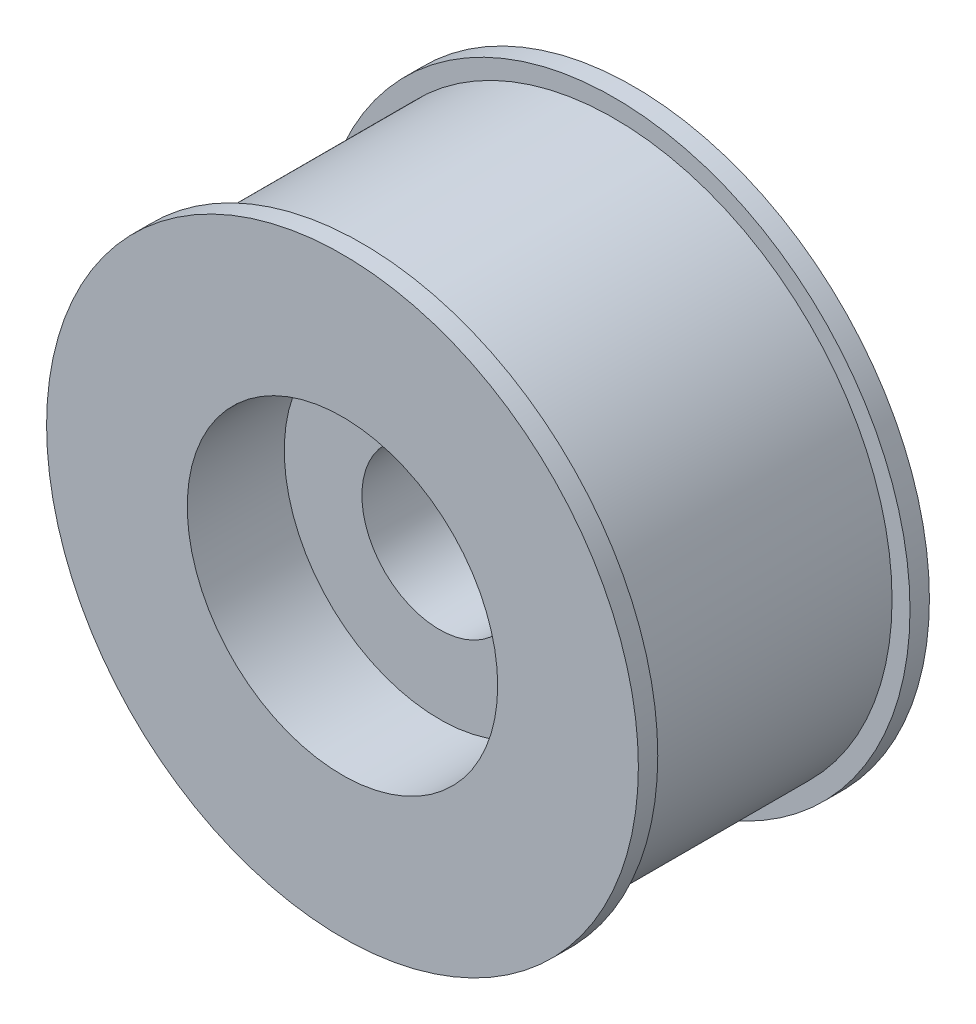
from build123d import *

# Parameters (mm, degrees)
SKETCH3_R          = 16
CUT_EXTRUDE1_DEPTH = 10
CUT_EXTRUDE2_START = -10
SKETCH4_R          = 16
CUT_EXTRUDE2_DEPTH = 10
SKETCH5_R          = 8
CUT_EXTRUDE3_DEPTH = 20


with BuildPart() as part:
    # Sketch1 → Revolve1 (revolve)
    with BuildSketch(Plane(origin=(0, 0, 0), x_dir=(0, 0, -1), z_dir=(1, 0, 0)), mode=Mode.PRIVATE) as revolve1_sk:
        Polygon((0, 0), (0, 30.5), (2, 30.5), (2, 28.65), (28, 28.65), (28, 30.5), (30, 30.5), (30, 19), (36, 19), (36, 0), align=None)
    revolve(revolve1_sk.sketch.rotate(Axis((0, 0, 18.162162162), (0, 0, -1)), 90), axis=Axis((0, 0, 18.162162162), (0, 0, -1)))

    # Sketch3 → Cut-Extrude1 (cut)
    with BuildSketch(Plane(origin=(0, 0, -36), x_dir=(-1, 0, 0), z_dir=(0, 0, -1))):
        Circle(SKETCH3_R)
    extrude(amount=-CUT_EXTRUDE1_DEPTH, mode=Mode.SUBTRACT)

    # Sketch4 → Cut-Extrude2 (cut)
    with BuildSketch(Plane.XY.offset(CUT_EXTRUDE2_START)):
        with Locations(Location((0, 0, 0), (0, 0, 180))):
            Circle(SKETCH4_R)
    extrude(amount=CUT_EXTRUDE2_DEPTH, mode=Mode.SUBTRACT)

    # Sketch5 → Cut-Extrude3 (cut)
    with BuildSketch(Plane.XY.offset(-10)):
        Circle(SKETCH5_R)
    extrude(amount=-CUT_EXTRUDE3_DEPTH, mode=Mode.SUBTRACT)


solid = part.part
